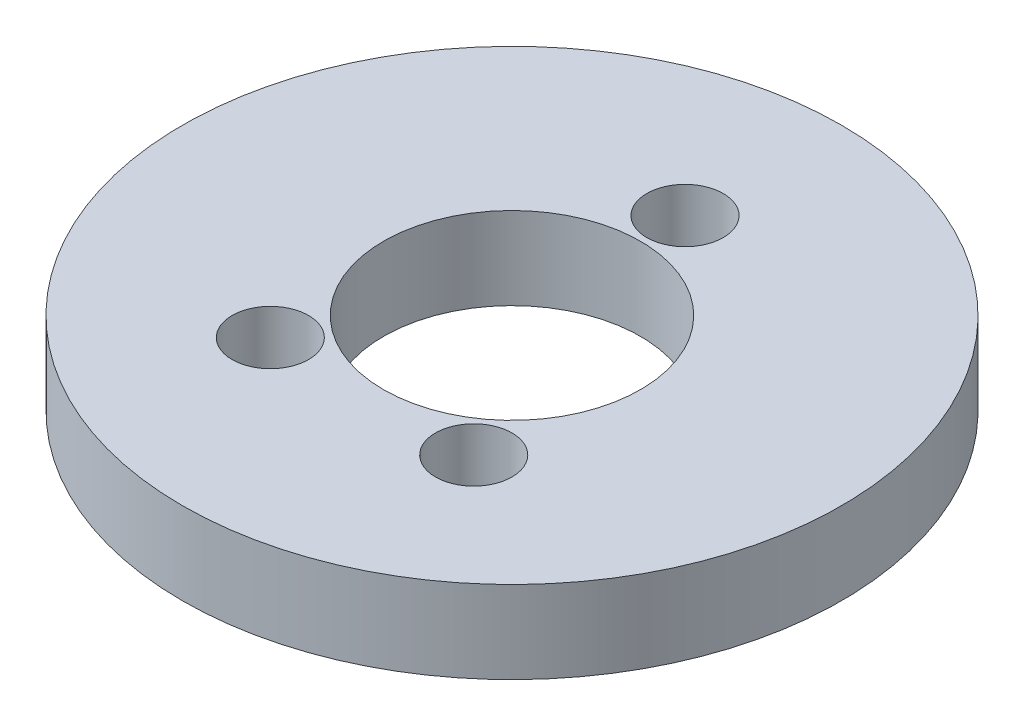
from build123d import *

# Parameters (mm, degrees)
SKETCH1_R           = 12.7
SKETCH1_R_2         = 4.953
SKETCH1_R_3         = 1.4732
BOSS_EXTRUDE1_DEPTH = 3.175


with BuildPart() as part:
    # Sketch1 → Boss-Extrude1 (new body)
    with BuildSketch(Plane(origin=(0, 0, 0), x_dir=(1, 0, 0), z_dir=(0, 1, 0))):
        with Locations(Location((0, 0, 0), (0, 0, 270))):
            Circle(SKETCH1_R)
        with Locations(Location((0, 0, 0), (0, 0, 270))):
            Circle(SKETCH1_R_2, mode=Mode.SUBTRACT)
        with Locations(Location((0, 6.6675, 0), (0, 0, 270))):
            Circle(SKETCH1_R_3, mode=Mode.SUBTRACT)
        with Locations(Location((3.91905817, -5.39412081, 0), (0, 0, 270))):
            Circle(SKETCH1_R_3, mode=Mode.SUBTRACT)
        with Locations(Location((-3.91905817, -5.39412081, 0), (0, 0, 270))):
            Circle(SKETCH1_R_3, mode=Mode.SUBTRACT)
    extrude(amount=BOSS_EXTRUDE1_DEPTH)


solid = part.part
